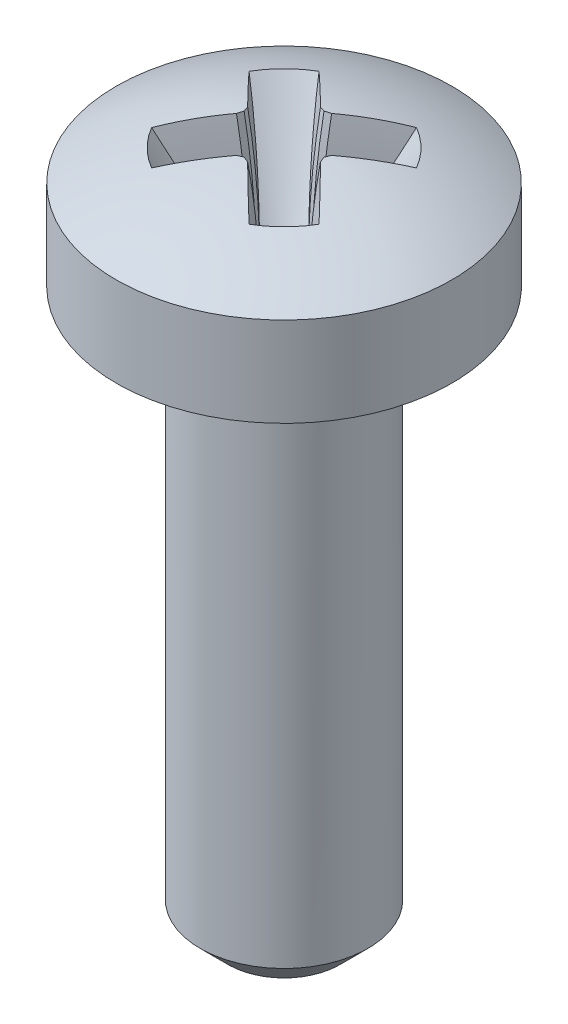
from build123d import *

# Parameters (mm, degrees)
R_P_TITION_CIRCULAIRE1_COUNT = 4


with BuildPart() as part:
    # Esquisse1 → R_volution1 (revolve)
    with BuildSketch(Plane.XY):
        with BuildLine():
            Line((0, 0), (-1, 0))
            Line((-1, 0), (-1.5, 0.5))
            Line((-1.5, 0.5), (-1.5, 10))
            Line((-1.5, 10), (-3, 10))
            Line((-3, 10), (-3, 11.6))
            ThreePointArc((-3, 11.6), (-1.55241747, 12.196565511), (0, 12.4))
            Line((0, 12.4), (0, 0))
        make_face()
    revolve(axis=Axis((0, 12.4, 0), (0, -1, 0)))


with BuildPart() as body_2:
    # Esquisse4 → R_volution2 (revolve)
    with BuildSketch(Plane.XY):
        Polygon((0, 20.1), (-3, 20.1), (-3, 14.343524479), (-0.55, 10.1), (0, 10.1), align=None)
    revolve(axis=Axis((0, 10.1, 0), (0, 1, 0)))

    # Esquisse5 → Enl_vement de mati_re-R_volution2 (revolve, cut)
    with BuildSketch(Plane.XZ.offset(-10.1)):
        Polygon((-12.5, 12.063602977), (-0.536397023, 0.1), (-0.5, 0), (-0.536397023, -0.1), (-12.5, -12.063602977), align=None)
    enl_vement_de_mati_re_r_volution2 = revolve(axis=Axis((-12.5, 10.1, -12.063602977), (0, 0, 1)), mode=Mode.SUBTRACT)

    # R_p_tition circulaire1: Enl_vement de mati_re-R_volution2 ×4 about axis
    r_p_tition_circulaire1_axis = Axis((0, 10.1, 0), (0, 1, 0))
    for i in range(1, R_P_TITION_CIRCULAIRE1_COUNT):
        add(enl_vement_de_mati_re_r_volution2.rotate(r_p_tition_circulaire1_axis, i * 360 / R_P_TITION_CIRCULAIRE1_COUNT), mode=Mode.SUBTRACT)


with BuildPart() as part_1:
    add(part.part)

    # Combiner1: cut body 2
    add(body_2.part, mode=Mode.SUBTRACT)


solid = part_1.part
